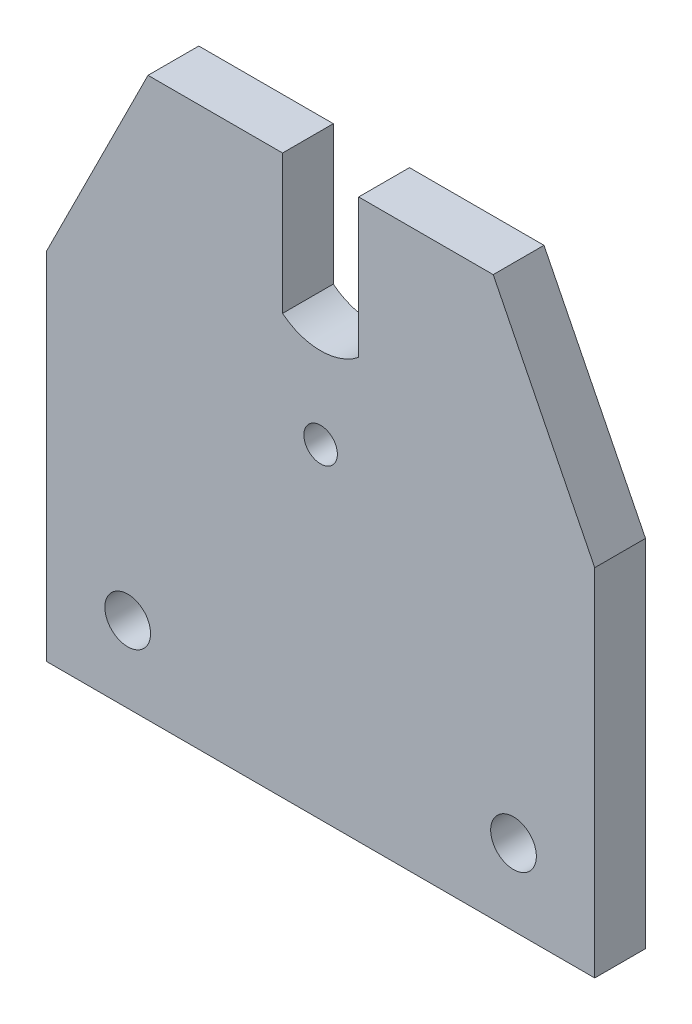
ISO-10303-21;
HEADER;
FILE_DESCRIPTION(('STEP AP214'),'2;1');
FILE_NAME('part.step','',(''),(''),'','','');
FILE_SCHEMA(('AUTOMOTIVE_DESIGN { 1 0 10303 214 1 1 1 1 }'));
ENDSEC;
DATA;
#1=APPLICATION_CONTEXT('core data for automotive mechanical design processes');
#2=APPLICATION_PROTOCOL_DEFINITION('international standard','automotive_design',2000,#1);
#3=PRODUCT_CONTEXT('',#1,'mechanical');
#4=PRODUCT('Part','Part','',(#3));
#5=PRODUCT_RELATED_PRODUCT_CATEGORY('part','',(#4));
#6=PRODUCT_DEFINITION_FORMATION('','',#4);
#7=PRODUCT_DEFINITION_CONTEXT('part definition',#1,'design');
#8=PRODUCT_DEFINITION('design','',#6,#7);
#9=PRODUCT_DEFINITION_SHAPE('','',#8);
#10=(LENGTH_UNIT() NAMED_UNIT(*) SI_UNIT(.MILLI.,.METRE.));
#11=(NAMED_UNIT(*) PLANE_ANGLE_UNIT() SI_UNIT($,.RADIAN.));
#12=(NAMED_UNIT(*) SI_UNIT($,.STERADIAN.) SOLID_ANGLE_UNIT());
#13=UNCERTAINTY_MEASURE_WITH_UNIT(LENGTH_MEASURE(1.E-05),#10,'distance_accuracy_value','');
#14=(GEOMETRIC_REPRESENTATION_CONTEXT(3) GLOBAL_UNCERTAINTY_ASSIGNED_CONTEXT((#13)) GLOBAL_UNIT_ASSIGNED_CONTEXT((#10,
#11,#12)) REPRESENTATION_CONTEXT('',''));
#15=CARTESIAN_POINT('',(0.,0.,0.));
#16=DIRECTION('',(0.,0.,1.));
#17=DIRECTION('',(1.,0.,0.));
#18=AXIS2_PLACEMENT_3D('',#15,#16,#17);
#19=CARTESIAN_POINT('',(27.,46.,5.));
#20=DIRECTION('',(0.,0.,1.));
#21=DIRECTION('',(1.,0.,0.));
#22=AXIS2_PLACEMENT_3D('',#19,#20,#21);
#23=PLANE('',#22);
#24=CARTESIAN_POINT('',(46.,7.5,5.));
#25=DIRECTION('',(0.,0.,1.));
#26=DIRECTION('',(1.,0.,0.));
#27=AXIS2_PLACEMENT_3D('',#24,#25,#26);
#28=CIRCLE('',#27,2.25);
#29=CARTESIAN_POINT('',(48.25,7.5,5.));
#30=VERTEX_POINT('',#29);
#31=EDGE_CURVE('E211',#30,#30,#28,.T.);
#32=ORIENTED_EDGE('',*,*,#31,.F.);
#33=EDGE_LOOP('',(#32));
#34=FACE_BOUND('',#33,.T.);
#35=DIRECTION('',(0.,-1.,0.));
#36=VECTOR('',#35,1.);
#37=CARTESIAN_POINT('',(0.,0.,5.));
#38=LINE('',#37,#36);
#39=CARTESIAN_POINT('',(0.,35.,5.));
#40=VERTEX_POINT('',#39);
#41=CARTESIAN_POINT('',(0.,0.,5.));
#42=VERTEX_POINT('',#41);
#43=EDGE_CURVE('E160',#40,#42,#38,.T.);
#44=ORIENTED_EDGE('',*,*,#43,.T.);
#45=DIRECTION('',(1.,0.,0.));
#46=VECTOR('',#45,1.);
#47=CARTESIAN_POINT('',(0.,0.,5.));
#48=LINE('',#47,#46);
#49=CARTESIAN_POINT('',(54.,0.,5.));
#50=VERTEX_POINT('',#49);
#51=EDGE_CURVE('E98',#42,#50,#48,.T.);
#52=ORIENTED_EDGE('',*,*,#51,.T.);
#53=DIRECTION('',(0.,1.,0.));
#54=VECTOR('',#53,1.);
#55=CARTESIAN_POINT('',(54.,0.,5.));
#56=LINE('',#55,#54);
#57=CARTESIAN_POINT('',(54.,35.,5.));
#58=VERTEX_POINT('',#57);
#59=EDGE_CURVE('E181',#50,#58,#56,.T.);
#60=ORIENTED_EDGE('',*,*,#59,.T.);
#61=DIRECTION('',(-0.447213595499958,0.894427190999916,0.));
#62=VECTOR('',#61,1.);
#63=CARTESIAN_POINT('',(54.,35.,5.));
#64=LINE('',#63,#62);
#65=CARTESIAN_POINT('',(44.,55.,5.));
#66=VERTEX_POINT('',#65);
#67=EDGE_CURVE('E200',#58,#66,#64,.T.);
#68=ORIENTED_EDGE('',*,*,#67,.T.);
#69=DIRECTION('',(-1.,0.,0.));
#70=VECTOR('',#69,1.);
#71=CARTESIAN_POINT('',(30.75,55.,5.));
#72=LINE('',#71,#70);
#73=CARTESIAN_POINT('',(30.75,55.,5.));
#74=VERTEX_POINT('',#73);
#75=EDGE_CURVE('E197',#66,#74,#72,.T.);
#76=ORIENTED_EDGE('',*,*,#75,.T.);
#77=DIRECTION('',(0.,-1.,0.));
#78=VECTOR('',#77,1.);
#79=CARTESIAN_POINT('',(30.75,41.3162515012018,5.));
#80=LINE('',#79,#78);
#81=CARTESIAN_POINT('',(30.75,41.3162515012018,5.));
#82=VERTEX_POINT('',#81);
#83=EDGE_CURVE('E199',#74,#82,#80,.T.);
#84=ORIENTED_EDGE('',*,*,#83,.T.);
#85=CARTESIAN_POINT('',(27.,46.,5.));
#86=DIRECTION('',(0.,0.,-1.));
#87=DIRECTION('',(1.,0.,0.));
#88=AXIS2_PLACEMENT_3D('',#85,#86,#87);
#89=CIRCLE('',#88,5.99999999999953);
#90=CARTESIAN_POINT('',(23.25,41.3162515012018,5.));
#91=VERTEX_POINT('',#90);
#92=EDGE_CURVE('E123',#82,#91,#89,.T.);
#93=ORIENTED_EDGE('',*,*,#92,.T.);
#94=DIRECTION('',(0.,1.,0.));
#95=VECTOR('',#94,1.);
#96=CARTESIAN_POINT('',(23.25,41.3162515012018,5.));
#97=LINE('',#96,#95);
#98=CARTESIAN_POINT('',(23.25,55.,5.));
#99=VERTEX_POINT('',#98);
#100=EDGE_CURVE('E117',#91,#99,#97,.T.);
#101=ORIENTED_EDGE('',*,*,#100,.T.);
#102=DIRECTION('',(-1.,0.,0.));
#103=VECTOR('',#102,1.);
#104=CARTESIAN_POINT('',(10.,55.,5.));
#105=LINE('',#104,#103);
#106=CARTESIAN_POINT('',(10.,55.,5.));
#107=VERTEX_POINT('',#106);
#108=EDGE_CURVE('E121',#99,#107,#105,.T.);
#109=ORIENTED_EDGE('',*,*,#108,.T.);
#110=DIRECTION('',(-0.447213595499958,-0.894427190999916,0.));
#111=VECTOR('',#110,1.);
#112=CARTESIAN_POINT('',(10.,55.,5.));
#113=LINE('',#112,#111);
#114=EDGE_CURVE('E49',#107,#40,#113,.T.);
#115=ORIENTED_EDGE('',*,*,#114,.T.);
#116=EDGE_LOOP('',(#44,#52,#60,#68,#76,#84,#93,#101,#109,#115));
#117=FACE_BOUND('',#116,.T.);
#118=CARTESIAN_POINT('',(8.,7.5,5.));
#119=DIRECTION('',(0.,0.,1.));
#120=DIRECTION('',(1.,0.,0.));
#121=AXIS2_PLACEMENT_3D('',#118,#119,#120);
#122=CIRCLE('',#121,2.25);
#123=CARTESIAN_POINT('',(10.25,7.5,5.));
#124=VERTEX_POINT('',#123);
#125=EDGE_CURVE('E145',#124,#124,#122,.T.);
#126=ORIENTED_EDGE('',*,*,#125,.F.);
#127=EDGE_LOOP('',(#126));
#128=FACE_BOUND('',#127,.T.);
#129=CARTESIAN_POINT('',(27.,32.,5.));
#130=DIRECTION('',(0.,0.,1.));
#131=DIRECTION('',(1.,0.,0.));
#132=AXIS2_PLACEMENT_3D('',#129,#130,#131);
#133=CIRCLE('',#132,1.65000000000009);
#134=CARTESIAN_POINT('',(28.6500000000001,32.,5.));
#135=VERTEX_POINT('',#134);
#136=EDGE_CURVE('E217',#135,#135,#133,.T.);
#137=ORIENTED_EDGE('',*,*,#136,.F.);
#138=EDGE_LOOP('',(#137));
#139=FACE_BOUND('',#138,.T.);
#140=ADVANCED_FACE('F32',(#34,#117,#128,#139),#23,.T.);
#141=CARTESIAN_POINT('',(27.,46.,0.));
#142=DIRECTION('',(0.,0.,1.));
#143=DIRECTION('',(1.,0.,0.));
#144=AXIS2_PLACEMENT_3D('',#141,#142,#143);
#145=PLANE('',#144);
#146=CARTESIAN_POINT('',(46.,7.5,0.));
#147=DIRECTION('',(0.,0.,1.));
#148=DIRECTION('',(1.,0.,0.));
#149=AXIS2_PLACEMENT_3D('',#146,#147,#148);
#150=CIRCLE('',#149,2.25);
#151=CARTESIAN_POINT('',(48.25,7.5,0.));
#152=VERTEX_POINT('',#151);
#153=EDGE_CURVE('E214',#152,#152,#150,.T.);
#154=ORIENTED_EDGE('',*,*,#153,.T.);
#155=EDGE_LOOP('',(#154));
#156=FACE_BOUND('',#155,.T.);
#157=DIRECTION('',(0.,-1.,0.));
#158=VECTOR('',#157,1.);
#159=CARTESIAN_POINT('',(0.,0.,0.));
#160=LINE('',#159,#158);
#161=CARTESIAN_POINT('',(0.,35.,0.));
#162=VERTEX_POINT('',#161);
#163=CARTESIAN_POINT('',(0.,0.,0.));
#164=VERTEX_POINT('',#163);
#165=EDGE_CURVE('E141',#162,#164,#160,.T.);
#166=ORIENTED_EDGE('',*,*,#165,.F.);
#167=DIRECTION('',(-0.447213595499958,-0.894427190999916,0.));
#168=VECTOR('',#167,1.);
#169=CARTESIAN_POINT('',(10.,55.,0.));
#170=LINE('',#169,#168);
#171=CARTESIAN_POINT('',(10.,55.,0.));
#172=VERTEX_POINT('',#171);
#173=EDGE_CURVE('E90',#172,#162,#170,.T.);
#174=ORIENTED_EDGE('',*,*,#173,.F.);
#175=DIRECTION('',(-1.,0.,0.));
#176=VECTOR('',#175,1.);
#177=CARTESIAN_POINT('',(10.,55.,0.));
#178=LINE('',#177,#176);
#179=CARTESIAN_POINT('',(23.25,55.,0.));
#180=VERTEX_POINT('',#179);
#181=EDGE_CURVE('E84',#180,#172,#178,.T.);
#182=ORIENTED_EDGE('',*,*,#181,.F.);
#183=DIRECTION('',(0.,1.,0.));
#184=VECTOR('',#183,1.);
#185=CARTESIAN_POINT('',(23.25,41.3162515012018,0.));
#186=LINE('',#185,#184);
#187=CARTESIAN_POINT('',(23.25,41.3162515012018,0.));
#188=VERTEX_POINT('',#187);
#189=EDGE_CURVE('E131',#188,#180,#186,.T.);
#190=ORIENTED_EDGE('',*,*,#189,.F.);
#191=CARTESIAN_POINT('',(27.,46.,0.));
#192=DIRECTION('',(0.,0.,-1.));
#193=DIRECTION('',(1.,0.,0.));
#194=AXIS2_PLACEMENT_3D('',#191,#192,#193);
#195=CIRCLE('',#194,5.99999999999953);
#196=CARTESIAN_POINT('',(30.75,41.3162515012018,0.));
#197=VERTEX_POINT('',#196);
#198=EDGE_CURVE('E155',#197,#188,#195,.T.);
#199=ORIENTED_EDGE('',*,*,#198,.F.);
#200=DIRECTION('',(0.,-1.,0.));
#201=VECTOR('',#200,1.);
#202=CARTESIAN_POINT('',(30.75,41.3162515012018,0.));
#203=LINE('',#202,#201);
#204=CARTESIAN_POINT('',(30.75,55.,0.));
#205=VERTEX_POINT('',#204);
#206=EDGE_CURVE('E153',#205,#197,#203,.T.);
#207=ORIENTED_EDGE('',*,*,#206,.F.);
#208=DIRECTION('',(-1.,0.,0.));
#209=VECTOR('',#208,1.);
#210=CARTESIAN_POINT('',(30.75,55.,0.));
#211=LINE('',#210,#209);
#212=CARTESIAN_POINT('',(44.,55.,0.));
#213=VERTEX_POINT('',#212);
#214=EDGE_CURVE('E151',#213,#205,#211,.T.);
#215=ORIENTED_EDGE('',*,*,#214,.F.);
#216=DIRECTION('',(-0.447213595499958,0.894427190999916,0.));
#217=VECTOR('',#216,1.);
#218=CARTESIAN_POINT('',(54.,35.,0.));
#219=LINE('',#218,#217);
#220=CARTESIAN_POINT('',(54.,35.,0.));
#221=VERTEX_POINT('',#220);
#222=EDGE_CURVE('E149',#221,#213,#219,.T.);
#223=ORIENTED_EDGE('',*,*,#222,.F.);
#224=DIRECTION('',(0.,1.,0.));
#225=VECTOR('',#224,1.);
#226=CARTESIAN_POINT('',(54.,0.,0.));
#227=LINE('',#226,#225);
#228=CARTESIAN_POINT('',(54.,0.,0.));
#229=VERTEX_POINT('',#228);
#230=EDGE_CURVE('E147',#229,#221,#227,.T.);
#231=ORIENTED_EDGE('',*,*,#230,.F.);
#232=DIRECTION('',(1.,0.,0.));
#233=VECTOR('',#232,1.);
#234=CARTESIAN_POINT('',(0.,0.,0.));
#235=LINE('',#234,#233);
#236=EDGE_CURVE('E144',#164,#229,#235,.T.);
#237=ORIENTED_EDGE('',*,*,#236,.F.);
#238=EDGE_LOOP('',(#166,#174,#182,#190,#199,#207,#215,#223,#231,#237));
#239=FACE_BOUND('',#238,.T.);
#240=CARTESIAN_POINT('',(8.,7.5,0.));
#241=DIRECTION('',(0.,0.,1.));
#242=DIRECTION('',(1.,0.,0.));
#243=AXIS2_PLACEMENT_3D('',#240,#241,#242);
#244=CIRCLE('',#243,2.25);
#245=CARTESIAN_POINT('',(10.25,7.5,0.));
#246=VERTEX_POINT('',#245);
#247=EDGE_CURVE('E208',#246,#246,#244,.T.);
#248=ORIENTED_EDGE('',*,*,#247,.T.);
#249=EDGE_LOOP('',(#248));
#250=FACE_BOUND('',#249,.T.);
#251=CARTESIAN_POINT('',(27.,32.,0.));
#252=DIRECTION('',(0.,0.,1.));
#253=DIRECTION('',(1.,0.,0.));
#254=AXIS2_PLACEMENT_3D('',#251,#252,#253);
#255=CIRCLE('',#254,1.65000000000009);
#256=CARTESIAN_POINT('',(28.6500000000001,32.,0.));
#257=VERTEX_POINT('',#256);
#258=EDGE_CURVE('E220',#257,#257,#255,.T.);
#259=ORIENTED_EDGE('',*,*,#258,.T.);
#260=EDGE_LOOP('',(#259));
#261=FACE_BOUND('',#260,.T.);
#262=ADVANCED_FACE('F185',(#156,#239,#250,#261),#145,.F.);
#263=CARTESIAN_POINT('',(0.,0.,5.));
#264=DIRECTION('',(1.,0.,0.));
#265=DIRECTION('',(0.,0.,-1.));
#266=AXIS2_PLACEMENT_3D('',#263,#264,#265);
#267=PLANE('',#266);
#268=ORIENTED_EDGE('',*,*,#165,.T.);
#269=DIRECTION('',(0.,0.,-1.));
#270=VECTOR('',#269,1.);
#271=CARTESIAN_POINT('',(0.,0.,5.));
#272=LINE('',#271,#270);
#273=EDGE_CURVE('E11',#42,#164,#272,.T.);
#274=ORIENTED_EDGE('',*,*,#273,.F.);
#275=ORIENTED_EDGE('',*,*,#43,.F.);
#276=DIRECTION('',(0.,0.,-1.));
#277=VECTOR('',#276,1.);
#278=CARTESIAN_POINT('',(0.,35.,5.));
#279=LINE('',#278,#277);
#280=EDGE_CURVE('E137',#40,#162,#279,.T.);
#281=ORIENTED_EDGE('',*,*,#280,.T.);
#282=EDGE_LOOP('',(#268,#274,#275,#281));
#283=FACE_BOUND('',#282,.T.);
#284=ADVANCED_FACE('F34',(#283),#267,.F.);
#285=CARTESIAN_POINT('',(0.,0.,5.));
#286=DIRECTION('',(0.,1.,0.));
#287=DIRECTION('',(0.,0.,1.));
#288=AXIS2_PLACEMENT_3D('',#285,#286,#287);
#289=PLANE('',#288);
#290=ORIENTED_EDGE('',*,*,#236,.T.);
#291=DIRECTION('',(0.,0.,-1.));
#292=VECTOR('',#291,1.);
#293=CARTESIAN_POINT('',(54.,0.,5.));
#294=LINE('',#293,#292);
#295=EDGE_CURVE('E41',#50,#229,#294,.T.);
#296=ORIENTED_EDGE('',*,*,#295,.F.);
#297=ORIENTED_EDGE('',*,*,#51,.F.);
#298=ORIENTED_EDGE('',*,*,#273,.T.);
#299=EDGE_LOOP('',(#290,#296,#297,#298));
#300=FACE_BOUND('',#299,.T.);
#301=ADVANCED_FACE('F262',(#300),#289,.F.);
#302=CARTESIAN_POINT('',(54.,0.,5.));
#303=DIRECTION('',(-1.,0.,0.));
#304=DIRECTION('',(0.,0.,1.));
#305=AXIS2_PLACEMENT_3D('',#302,#303,#304);
#306=PLANE('',#305);
#307=ORIENTED_EDGE('',*,*,#230,.T.);
#308=DIRECTION('',(0.,0.,-1.));
#309=VECTOR('',#308,1.);
#310=CARTESIAN_POINT('',(54.,35.,5.));
#311=LINE('',#310,#309);
#312=EDGE_CURVE('E173',#58,#221,#311,.T.);
#313=ORIENTED_EDGE('',*,*,#312,.F.);
#314=ORIENTED_EDGE('',*,*,#59,.F.);
#315=ORIENTED_EDGE('',*,*,#295,.T.);
#316=EDGE_LOOP('',(#307,#313,#314,#315));
#317=FACE_BOUND('',#316,.T.);
#318=ADVANCED_FACE('F179',(#317),#306,.F.);
#319=CARTESIAN_POINT('',(54.,35.,5.));
#320=DIRECTION('',(-0.894427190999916,-0.447213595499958,0.));
#321=DIRECTION('',(0.447213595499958,-0.894427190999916,0.));
#322=AXIS2_PLACEMENT_3D('',#319,#320,#321);
#323=PLANE('',#322);
#324=ORIENTED_EDGE('',*,*,#222,.T.);
#325=DIRECTION('',(0.,0.,-1.));
#326=VECTOR('',#325,1.);
#327=CARTESIAN_POINT('',(44.,55.,5.));
#328=LINE('',#327,#326);
#329=EDGE_CURVE('E170',#66,#213,#328,.T.);
#330=ORIENTED_EDGE('',*,*,#329,.F.);
#331=ORIENTED_EDGE('',*,*,#67,.F.);
#332=ORIENTED_EDGE('',*,*,#312,.T.);
#333=EDGE_LOOP('',(#324,#330,#331,#332));
#334=FACE_BOUND('',#333,.T.);
#335=ADVANCED_FACE('F191',(#334),#323,.F.);
#336=CARTESIAN_POINT('',(30.75,55.,5.));
#337=DIRECTION('',(0.,-1.,0.));
#338=DIRECTION('',(0.,0.,-1.));
#339=AXIS2_PLACEMENT_3D('',#336,#337,#338);
#340=PLANE('',#339);
#341=ORIENTED_EDGE('',*,*,#214,.T.);
#342=DIRECTION('',(0.,0.,-1.));
#343=VECTOR('',#342,1.);
#344=CARTESIAN_POINT('',(30.75,55.,5.));
#345=LINE('',#344,#343);
#346=EDGE_CURVE('E167',#74,#205,#345,.T.);
#347=ORIENTED_EDGE('',*,*,#346,.F.);
#348=ORIENTED_EDGE('',*,*,#75,.F.);
#349=ORIENTED_EDGE('',*,*,#329,.T.);
#350=EDGE_LOOP('',(#341,#347,#348,#349));
#351=FACE_BOUND('',#350,.T.);
#352=ADVANCED_FACE('F195',(#351),#340,.F.);
#353=CARTESIAN_POINT('',(30.75,41.3162515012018,5.));
#354=DIRECTION('',(1.,0.,0.));
#355=DIRECTION('',(0.,0.,-1.));
#356=AXIS2_PLACEMENT_3D('',#353,#354,#355);
#357=PLANE('',#356);
#358=ORIENTED_EDGE('',*,*,#206,.T.);
#359=DIRECTION('',(0.,0.,-1.));
#360=VECTOR('',#359,1.);
#361=CARTESIAN_POINT('',(30.75,41.3162515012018,5.));
#362=LINE('',#361,#360);
#363=EDGE_CURVE('E164',#82,#197,#362,.T.);
#364=ORIENTED_EDGE('',*,*,#363,.F.);
#365=ORIENTED_EDGE('',*,*,#83,.F.);
#366=ORIENTED_EDGE('',*,*,#346,.T.);
#367=EDGE_LOOP('',(#358,#364,#365,#366));
#368=FACE_BOUND('',#367,.T.);
#369=ADVANCED_FACE('F252',(#368),#357,.F.);
#370=CARTESIAN_POINT('',(27.,46.,5.));
#371=DIRECTION('',(0.,0.,-1.));
#372=DIRECTION('',(-1.,0.,0.));
#373=AXIS2_PLACEMENT_3D('',#370,#371,#372);
#374=CYLINDRICAL_SURFACE('',#373,5.99999999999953);
#375=ORIENTED_EDGE('',*,*,#198,.T.);
#376=DIRECTION('',(0.,0.,-1.));
#377=VECTOR('',#376,1.);
#378=CARTESIAN_POINT('',(23.25,41.3162515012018,5.));
#379=LINE('',#378,#377);
#380=EDGE_CURVE('E132',#91,#188,#379,.T.);
#381=ORIENTED_EDGE('',*,*,#380,.F.);
#382=ORIENTED_EDGE('',*,*,#92,.F.);
#383=ORIENTED_EDGE('',*,*,#363,.T.);
#384=EDGE_LOOP('',(#375,#381,#382,#383));
#385=FACE_BOUND('',#384,.T.);
#386=ADVANCED_FACE('F249',(#385),#374,.F.);
#387=CARTESIAN_POINT('',(23.25,41.3162515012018,5.));
#388=DIRECTION('',(-1.,0.,0.));
#389=DIRECTION('',(0.,0.,1.));
#390=AXIS2_PLACEMENT_3D('',#387,#388,#389);
#391=PLANE('',#390);
#392=ORIENTED_EDGE('',*,*,#189,.T.);
#393=DIRECTION('',(0.,0.,-1.));
#394=VECTOR('',#393,1.);
#395=CARTESIAN_POINT('',(23.25,55.,5.));
#396=LINE('',#395,#394);
#397=EDGE_CURVE('E128',#99,#180,#396,.T.);
#398=ORIENTED_EDGE('',*,*,#397,.F.);
#399=ORIENTED_EDGE('',*,*,#100,.F.);
#400=ORIENTED_EDGE('',*,*,#380,.T.);
#401=EDGE_LOOP('',(#392,#398,#399,#400));
#402=FACE_BOUND('',#401,.T.);
#403=ADVANCED_FACE('F129',(#402),#391,.F.);
#404=CARTESIAN_POINT('',(10.,55.,5.));
#405=DIRECTION('',(0.,-1.,0.));
#406=DIRECTION('',(0.,0.,-1.));
#407=AXIS2_PLACEMENT_3D('',#404,#405,#406);
#408=PLANE('',#407);
#409=ORIENTED_EDGE('',*,*,#181,.T.);
#410=DIRECTION('',(0.,0.,-1.));
#411=VECTOR('',#410,1.);
#412=CARTESIAN_POINT('',(10.,55.,5.));
#413=LINE('',#412,#411);
#414=EDGE_CURVE('E133',#107,#172,#413,.T.);
#415=ORIENTED_EDGE('',*,*,#414,.F.);
#416=ORIENTED_EDGE('',*,*,#108,.F.);
#417=ORIENTED_EDGE('',*,*,#397,.T.);
#418=EDGE_LOOP('',(#409,#415,#416,#417));
#419=FACE_BOUND('',#418,.T.);
#420=ADVANCED_FACE('F135',(#419),#408,.F.);
#421=CARTESIAN_POINT('',(10.,55.,5.));
#422=DIRECTION('',(0.894427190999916,-0.447213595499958,0.));
#423=DIRECTION('',(0.447213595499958,0.894427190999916,0.));
#424=AXIS2_PLACEMENT_3D('',#421,#422,#423);
#425=PLANE('',#424);
#426=ORIENTED_EDGE('',*,*,#173,.T.);
#427=ORIENTED_EDGE('',*,*,#280,.F.);
#428=ORIENTED_EDGE('',*,*,#114,.F.);
#429=ORIENTED_EDGE('',*,*,#414,.T.);
#430=EDGE_LOOP('',(#426,#427,#428,#429));
#431=FACE_BOUND('',#430,.T.);
#432=ADVANCED_FACE('F242',(#431),#425,.F.);
#433=CARTESIAN_POINT('',(8.,7.5,5.));
#434=DIRECTION('',(0.,0.,-1.));
#435=DIRECTION('',(-1.,0.,0.));
#436=AXIS2_PLACEMENT_3D('',#433,#434,#435);
#437=CYLINDRICAL_SURFACE('',#436,2.25);
#438=ORIENTED_EDGE('',*,*,#125,.T.);
#439=EDGE_LOOP('',(#438));
#440=FACE_BOUND('',#439,.T.);
#441=ORIENTED_EDGE('',*,*,#247,.F.);
#442=EDGE_LOOP('',(#441));
#443=FACE_BOUND('',#442,.T.);
#444=ADVANCED_FACE('F239',(#440,#443),#437,.F.);
#445=CARTESIAN_POINT('',(46.,7.5,5.));
#446=DIRECTION('',(0.,0.,-1.));
#447=DIRECTION('',(-1.,0.,0.));
#448=AXIS2_PLACEMENT_3D('',#445,#446,#447);
#449=CYLINDRICAL_SURFACE('',#448,2.25);
#450=ORIENTED_EDGE('',*,*,#31,.T.);
#451=EDGE_LOOP('',(#450));
#452=FACE_BOUND('',#451,.T.);
#453=ORIENTED_EDGE('',*,*,#153,.F.);
#454=EDGE_LOOP('',(#453));
#455=FACE_BOUND('',#454,.T.);
#456=ADVANCED_FACE('F338',(#452,#455),#449,.F.);
#457=CARTESIAN_POINT('',(27.,32.,5.));
#458=DIRECTION('',(0.,0.,-1.));
#459=DIRECTION('',(-1.,0.,0.));
#460=AXIS2_PLACEMENT_3D('',#457,#458,#459);
#461=CYLINDRICAL_SURFACE('',#460,1.65000000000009);
#462=ORIENTED_EDGE('',*,*,#136,.T.);
#463=EDGE_LOOP('',(#462));
#464=FACE_BOUND('',#463,.T.);
#465=ORIENTED_EDGE('',*,*,#258,.F.);
#466=EDGE_LOOP('',(#465));
#467=FACE_BOUND('',#466,.T.);
#468=ADVANCED_FACE('F226',(#464,#467),#461,.F.);
#469=CLOSED_SHELL('',(#140,#262,#284,#301,#318,#335,#352,#369,#386,#403,#420,#432,#444,#456,#468));
#470=MANIFOLD_SOLID_BREP('B2',#469);
#471=ADVANCED_BREP_SHAPE_REPRESENTATION('',(#18,#470),#14);
#472=SHAPE_DEFINITION_REPRESENTATION(#9,#471);
ENDSEC;
END-ISO-10303-21;
